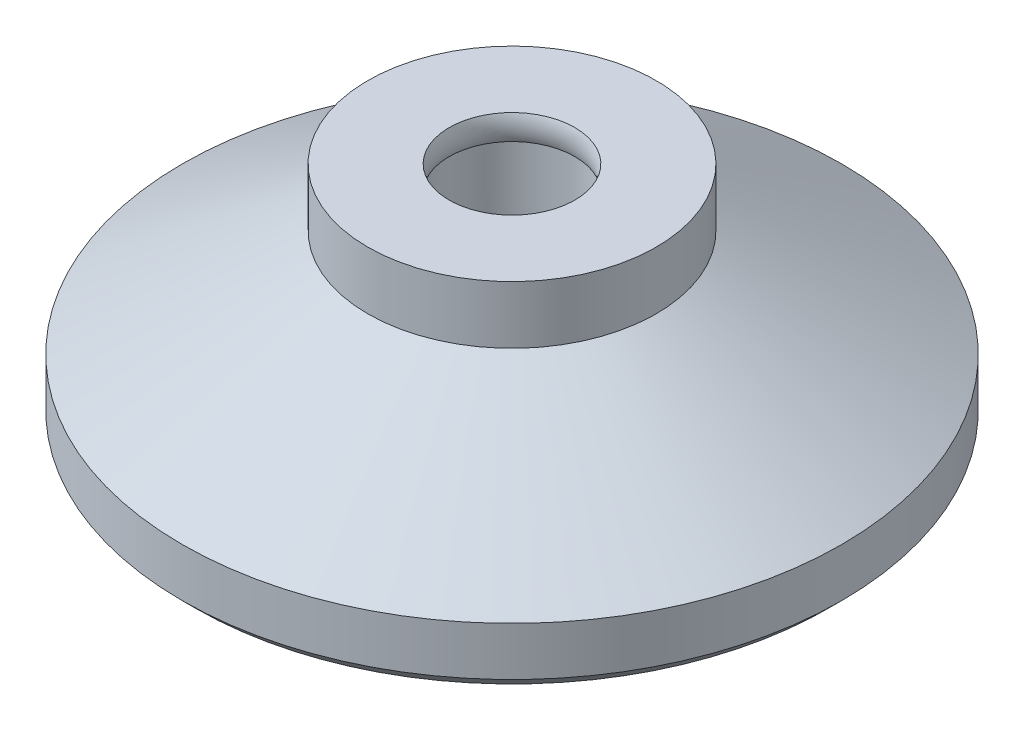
from build123d import *

# Parameters (mm, degrees)
SKETCH1_R      = 7
EXTRUDE1_DEPTH = 5.5
SKETCH3_R      = 16
EXTRUDE2_DEPTH = 3
CHAMFER1_SIZE  = 0.64


with BuildPart() as part:
    # Sketch1 → Extrude1 (new, symmetric)
    with BuildSketch(Plane(origin=(0, 0, 0), x_dir=(1, 0, 0), z_dir=(0, 1, 0))):
        with Locations(Location((0, 0, 0), (0, 0, 270))):
            Circle(SKETCH1_R)
    extrude(amount=EXTRUDE1_DEPTH, both=True)

    # Sketch3 → Extrude2 (add)
    with BuildSketch(Plane.XZ.offset(5.5)):
        with Locations(Location((0, 0, 0), (0, 0, 270))):
            Circle(SKETCH3_R)
    extrude(amount=-EXTRUDE2_DEPTH)

    # Sketch4 → Revolve1 (revolve)
    with BuildSketch(Plane.XY, mode=Mode.PRIVATE) as revolve1_sk:
        Polygon((-16, -2.5), (-7, 2.696152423), (-7, -2.5), align=None)
    revolve(revolve1_sk.sketch.rotate(Axis((0, 5.5, 0), (0, -1, 0)), 270), axis=Axis((0, 5.5, 0), (0, -1, 0)))

    # Chamfer1
    chamfer1_edges = [part.edges().sort_by_distance(p)[0] for p in [
        (0, -5.5, 16),
    ]]
    chamfer(chamfer1_edges, length=CHAMFER1_SIZE)

    # Sketch5 → Cut-Revolve1 (revolve, cut)
    with BuildSketch(Plane.XY, mode=Mode.PRIVATE) as cut_revolve1_sk:
        with BuildLine():
            Line((0, 5.5), (3.05, 5.5))
            ThreePointArc((3.05, 5.5), (2.928, 4.89), (3.05, 4.28))
            Line((3.05, 4.28), (3.05, -0.739081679))
            Line((3.05, -0.739081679), (0, -2.5))
            Line((0, -2.5), (0, 5.5))
        make_face()
    revolve(cut_revolve1_sk.sketch.rotate(Axis((0, 0, 0), (0, 1, 0)), 270), axis=Axis((0, 0, 0), (0, 1, 0)), mode=Mode.SUBTRACT)


solid = part.part
